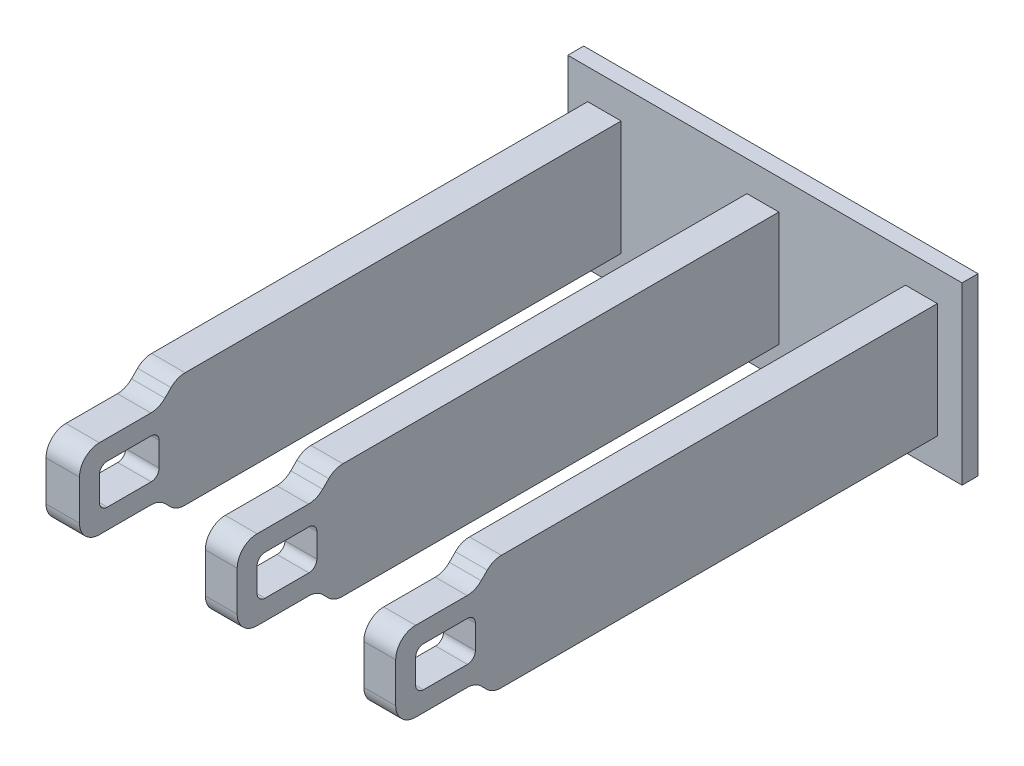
from build123d import *

# Parameters (mm, degrees)
ESQUISSE1_W             = 9.9
ESQUISSE1_H             = 4.4
BOSS_EXTRU_1_DEPTH      = 14
ESQUISSE2_W             = 0.5
ESQUISSE2_H             = 4.4
ESQUISSE2_W_2           = 3.16
ESQUISSE2_W_3           = 3.18
ESQUISSE2_W_4           = 0.62
ENL_V_MAT_EXTRU_1_DEPTH = 13.6
ESQUISSE3_W             = 8.78
ESQUISSE3_H             = 0.76
ENL_V_MAT_EXTRU_2_DEPTH = 13.6
ESQUISSE4_W             = 1.5
ESQUISSE4_H             = 1
ENL_V_MAT_EXTRU_3_DEPTH = 13.6
CONG_1_R                = 0.5
CONG_2_R                = 0.5
CONG_3_R                = 0.5
CONG_4_R                = 0.2


with BuildPart() as part:
    # Esquisse1 → Boss.-Extru.1 (new body)
    with BuildSketch(Plane.XY):
        with Locations((4.95, 2.2)):
            Rectangle(ESQUISSE1_W, ESQUISSE1_H)
    extrude(amount=BOSS_EXTRU_1_DEPTH)

    # Esquisse2 → Enl_v. mat.-Extru.1 (cut)
    with BuildSketch(Plane.XY.offset(14)):
        with Locations((0.25, 2.2)):
            Rectangle(ESQUISSE2_W, ESQUISSE2_H)
        with Locations((2.92, 2.2)):
            Rectangle(ESQUISSE2_W_2, ESQUISSE2_H)
        with Locations((6.89, 2.2)):
            Rectangle(ESQUISSE2_W_3, ESQUISSE2_H)
        with Locations((9.59, 2.2)):
            Rectangle(ESQUISSE2_W_4, ESQUISSE2_H)
    extrude(amount=-ENL_V_MAT_EXTRU_1_DEPTH, mode=Mode.SUBTRACT)

    # Esquisse3 → Enl_v. mat.-Extru.2 (cut)
    with BuildSketch(Plane.XY.offset(14)):
        with Locations((4.89, 4.02)):
            Rectangle(ESQUISSE3_W, ESQUISSE3_H)
        with Locations((4.89, 0.38)):
            Rectangle(ESQUISSE3_W, ESQUISSE3_H)
    extrude(amount=-ENL_V_MAT_EXTRU_2_DEPTH, mode=Mode.SUBTRACT)

    # Esquisse4 → Enl_v. mat.-Extru.3 (cut)
    with BuildSketch(Plane(origin=(9.28, 0, 0), x_dir=(0, 0, -1), z_dir=(1, 0, 0))):
        Polygon((-11.565641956, 0.76), (-14, 0.76), (-14, 1.194358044), (-12, 1.194358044), align=None)
        with Locations((-12.75, 2.194358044)):
            Rectangle(ESQUISSE4_W, ESQUISSE4_H)
        Polygon((-14, 3.194358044), (-12, 3.194358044), (-11.554358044, 3.64), (-14, 3.64), align=None)
    extrude(amount=-ENL_V_MAT_EXTRU_3_DEPTH, mode=Mode.SUBTRACT)

    # Cong_1
    cong_1_edges = [part.edges().sort_by_distance(p)[0] for p in [
        (0.92, 3.64, 11.554358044),
        (0.92, 3.194358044, 12),
        (0.92, 3.194358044, 14),
        (0.92, 0.76, 11.565641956),
        (0.92, 1.194358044, 14),
        (0.92, 1.194358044, 12),
    ]]
    fillet(cong_1_edges, radius=CONG_1_R)

    # Cong_2
    cong_2_edges = [part.edges().sort_by_distance(p)[0] for p in [
        (4.9, 3.194358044, 12),
        (4.9, 3.194358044, 14),
        (4.9, 3.64, 11.554358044),
        (4.9, 1.194358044, 14),
        (4.9, 0.76, 11.565641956),
        (4.9, 1.194358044, 12),
    ]]
    fillet(cong_2_edges, radius=CONG_2_R)

    # Cong_3
    cong_3_edges = [part.edges().sort_by_distance(p)[0] for p in [
        (8.88, 3.194358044, 14),
        (8.88, 3.64, 11.554358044),
        (8.88, 3.194358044, 12),
        (8.88, 1.194358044, 14),
        (8.88, 1.194358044, 12),
        (8.88, 0.76, 11.565641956),
    ]]
    fillet(cong_3_edges, radius=CONG_3_R)

    # Cong_4
    cong_4_edges = [part.edges().sort_by_distance(p)[0] for p in [
        (0.92, 1.694358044, 13.5),
        (4.9, 1.694358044, 13.5),
        (0.92, 2.694358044, 13.5),
        (4.9, 2.694358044, 13.5),
        (0.92, 2.694358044, 12),
        (4.9, 2.694358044, 12),
        (0.92, 1.694358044, 12),
        (4.9, 1.694358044, 12),
        (8.88, 1.694358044, 13.5),
        (8.88, 2.694358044, 13.5),
        (8.88, 2.694358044, 12),
        (8.88, 1.694358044, 12),
    ]]
    fillet(cong_4_edges, radius=CONG_4_R)


solid = part.part
